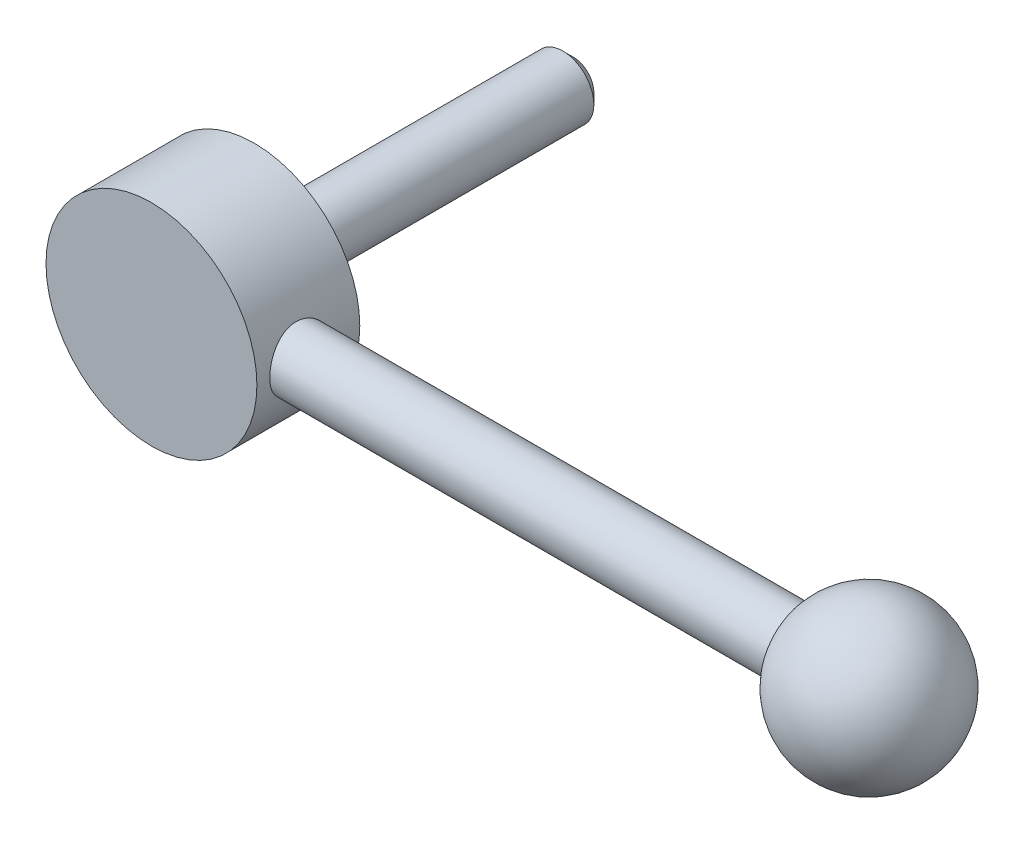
ISO-10303-21;
HEADER;
FILE_DESCRIPTION(('STEP AP214'),'2;1');
FILE_NAME('part.step','',(''),(''),'','','');
FILE_SCHEMA(('AUTOMOTIVE_DESIGN { 1 0 10303 214 1 1 1 1 }'));
ENDSEC;
DATA;
#1=APPLICATION_CONTEXT('core data for automotive mechanical design processes');
#2=APPLICATION_PROTOCOL_DEFINITION('international standard','automotive_design',2000,#1);
#3=PRODUCT_CONTEXT('',#1,'mechanical');
#4=PRODUCT('Part','Part','',(#3));
#5=PRODUCT_RELATED_PRODUCT_CATEGORY('part','',(#4));
#6=PRODUCT_DEFINITION_FORMATION('','',#4);
#7=PRODUCT_DEFINITION_CONTEXT('part definition',#1,'design');
#8=PRODUCT_DEFINITION('design','',#6,#7);
#9=PRODUCT_DEFINITION_SHAPE('','',#8);
#10=(LENGTH_UNIT() NAMED_UNIT(*) SI_UNIT(.MILLI.,.METRE.));
#11=(NAMED_UNIT(*) PLANE_ANGLE_UNIT() SI_UNIT($,.RADIAN.));
#12=(NAMED_UNIT(*) SI_UNIT($,.STERADIAN.) SOLID_ANGLE_UNIT());
#13=UNCERTAINTY_MEASURE_WITH_UNIT(LENGTH_MEASURE(1.E-05),#10,'distance_accuracy_value','');
#14=(GEOMETRIC_REPRESENTATION_CONTEXT(3) GLOBAL_UNCERTAINTY_ASSIGNED_CONTEXT((#13)) GLOBAL_UNIT_ASSIGNED_CONTEXT((#10,
#11,#12)) REPRESENTATION_CONTEXT('',''));
#15=CARTESIAN_POINT('',(0.,0.,0.));
#16=DIRECTION('',(0.,0.,1.));
#17=DIRECTION('',(1.,0.,0.));
#18=AXIS2_PLACEMENT_3D('',#15,#16,#17);
#19=CARTESIAN_POINT('',(0.,0.,40.));
#20=DIRECTION('',(0.,0.,1.));
#21=DIRECTION('',(1.,0.,0.));
#22=AXIS2_PLACEMENT_3D('',#19,#20,#21);
#23=CYLINDRICAL_SURFACE('',#22,9.5);
#24=CARTESIAN_POINT('',(0.,0.,2.));
#25=DIRECTION('',(0.,0.,1.));
#26=DIRECTION('',(1.,0.,0.));
#27=AXIS2_PLACEMENT_3D('',#24,#25,#26);
#28=CIRCLE('',#27,9.5);
#29=CARTESIAN_POINT('',(9.5,0.,2.));
#30=VERTEX_POINT('',#29);
#31=EDGE_CURVE('E37',#30,#30,#28,.T.);
#32=ORIENTED_EDGE('',*,*,#31,.F.);
#33=EDGE_LOOP('',(#32));
#34=FACE_BOUND('',#33,.T.);
#35=CARTESIAN_POINT('',(0.,0.,0.));
#36=DIRECTION('',(0.,0.,1.));
#37=DIRECTION('',(1.,0.,0.));
#38=AXIS2_PLACEMENT_3D('',#35,#36,#37);
#39=CIRCLE('',#38,9.5);
#40=CARTESIAN_POINT('',(9.5,0.,0.));
#41=VERTEX_POINT('',#40);
#42=EDGE_CURVE('E23',#41,#41,#39,.T.);
#43=ORIENTED_EDGE('',*,*,#42,.T.);
#44=EDGE_LOOP('',(#43));
#45=FACE_BOUND('',#44,.T.);
#46=ADVANCED_FACE('F12',(#34,#45),#23,.T.);
#47=CARTESIAN_POINT('',(6.,0.,0.));
#48=DIRECTION('',(0.,0.,1.));
#49=DIRECTION('',(1.,0.,0.));
#50=AXIS2_PLACEMENT_3D('',#47,#48,#49);
#51=PLANE('',#50);
#52=ORIENTED_EDGE('',*,*,#42,.F.);
#53=EDGE_LOOP('',(#52));
#54=FACE_BOUND('',#53,.T.);
#55=CARTESIAN_POINT('',(0.,0.,0.));
#56=DIRECTION('',(0.,0.,1.));
#57=DIRECTION('',(1.,0.,0.));
#58=AXIS2_PLACEMENT_3D('',#55,#56,#57);
#59=CIRCLE('',#58,6.);
#60=CARTESIAN_POINT('',(6.,0.,0.));
#61=VERTEX_POINT('',#60);
#62=EDGE_CURVE('E27',#61,#61,#59,.T.);
#63=ORIENTED_EDGE('',*,*,#62,.T.);
#64=EDGE_LOOP('',(#63));
#65=FACE_BOUND('',#64,.T.);
#66=ADVANCED_FACE('F63',(#54,#65),#51,.F.);
#67=CARTESIAN_POINT('',(0.,0.,40.));
#68=DIRECTION('',(0.,0.,1.));
#69=DIRECTION('',(1.,0.,0.));
#70=AXIS2_PLACEMENT_3D('',#67,#68,#69);
#71=CYLINDRICAL_SURFACE('',#70,6.);
#72=CARTESIAN_POINT('',(0.,0.,-58.));
#73=DIRECTION('',(0.,0.,-1.));
#74=DIRECTION('',(-1.,0.,0.));
#75=AXIS2_PLACEMENT_3D('',#72,#73,#74);
#76=CIRCLE('',#75,6.);
#77=CARTESIAN_POINT('',(-6.,0.,-58.));
#78=VERTEX_POINT('',#77);
#79=EDGE_CURVE('E19',#78,#78,#76,.F.);
#80=ORIENTED_EDGE('',*,*,#79,.T.);
#81=EDGE_LOOP('',(#80));
#82=FACE_BOUND('',#81,.T.);
#83=ORIENTED_EDGE('',*,*,#62,.F.);
#84=EDGE_LOOP('',(#83));
#85=FACE_BOUND('',#84,.T.);
#86=ADVANCED_FACE('F69',(#82,#85),#71,.T.);
#87=CARTESIAN_POINT('',(6.,0.,-60.));
#88=DIRECTION('',(0.,0.,-1.));
#89=DIRECTION('',(-1.,0.,0.));
#90=AXIS2_PLACEMENT_3D('',#87,#88,#89);
#91=PLANE('',#90);
#92=CARTESIAN_POINT('',(0.,0.,-60.));
#93=DIRECTION('',(0.,0.,-1.));
#94=DIRECTION('',(-1.,0.,0.));
#95=AXIS2_PLACEMENT_3D('',#92,#93,#94);
#96=CIRCLE('',#95,4.);
#97=CARTESIAN_POINT('',(-4.,0.,-60.));
#98=VERTEX_POINT('',#97);
#99=EDGE_CURVE('E8',#98,#98,#96,.T.);
#100=ORIENTED_EDGE('',*,*,#99,.T.);
#101=EDGE_LOOP('',(#100));
#102=FACE_BOUND('',#101,.T.);
#103=ADVANCED_FACE('F77',(#102),#91,.T.);
#104=CARTESIAN_POINT('',(20.5,0.,22.));
#105=DIRECTION('',(0.,0.,-1.));
#106=DIRECTION('',(-1.,0.,0.));
#107=AXIS2_PLACEMENT_3D('',#104,#105,#106);
#108=PLANE('',#107);
#109=CARTESIAN_POINT('',(0.,0.,22.));
#110=DIRECTION('',(0.,0.,1.));
#111=DIRECTION('',(1.,0.,0.));
#112=AXIS2_PLACEMENT_3D('',#109,#110,#111);
#113=CIRCLE('',#112,20.5);
#114=CARTESIAN_POINT('',(20.5,0.,22.));
#115=VERTEX_POINT('',#114);
#116=EDGE_CURVE('E86',#115,#115,#113,.T.);
#117=ORIENTED_EDGE('',*,*,#116,.T.);
#118=EDGE_LOOP('',(#117));
#119=FACE_BOUND('',#118,.T.);
#120=ADVANCED_FACE('F58',(#119),#108,.F.);
#121=CARTESIAN_POINT('',(0.,0.,40.));
#122=DIRECTION('',(0.,0.,1.));
#123=DIRECTION('',(1.,0.,0.));
#124=AXIS2_PLACEMENT_3D('',#121,#122,#123);
#125=CYLINDRICAL_SURFACE('',#124,20.5);
#126=CARTESIAN_POINT('',(20.5,0.,7.5));
#127=CARTESIAN_POINT('',(20.4999997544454,-0.164768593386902,7.50000038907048));
#128=CARTESIAN_POINT('',(20.4980087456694,-0.329544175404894,7.50679278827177));
#129=CARTESIAN_POINT('',(20.4900990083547,-0.65788822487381,7.5339021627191));
#130=CARTESIAN_POINT('',(20.4841800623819,-0.821456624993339,7.55421988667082));
#131=CARTESIAN_POINT('',(20.4685766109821,-1.1462122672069,7.60820100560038));
#132=CARTESIAN_POINT('',(20.4588916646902,-1.30739922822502,7.64186596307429));
#133=CARTESIAN_POINT('',(20.4360164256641,-1.62628314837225,7.72226244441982));
#134=CARTESIAN_POINT('',(20.4228249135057,-1.7839788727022,7.76899851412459));
#135=CARTESIAN_POINT('',(20.3933182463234,-2.09448185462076,7.87505403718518));
#136=CARTESIAN_POINT('',(20.3770082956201,-2.24729676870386,7.93435254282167));
#137=CARTESIAN_POINT('',(20.3416823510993,-2.54730770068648,8.06511256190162));
#138=CARTESIAN_POINT('',(20.3226662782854,-2.69450355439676,8.13657443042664));
#139=CARTESIAN_POINT('',(20.2824208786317,-2.98237032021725,8.2911456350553));
#140=CARTESIAN_POINT('',(20.2611910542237,-3.123039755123,8.37425759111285));
#141=CARTESIAN_POINT('',(20.2170775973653,-3.39691169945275,8.55150630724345));
#142=CARTESIAN_POINT('',(20.1941944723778,-3.53011647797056,8.6456396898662));
#143=CARTESIAN_POINT('',(20.146767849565,-3.79154794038,8.84682399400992));
#144=CARTESIAN_POINT('',(20.1221971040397,-3.91956600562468,8.95413966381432));
#145=CARTESIAN_POINT('',(20.0725990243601,-4.1661228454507,9.17897611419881));
#146=CARTESIAN_POINT('',(20.0475718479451,-4.2846648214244,9.29649342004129));
#147=CARTESIAN_POINT('',(19.9977175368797,-4.5116297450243,9.54108035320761));
#148=CARTESIAN_POINT('',(19.9728905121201,-4.62004743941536,9.66815487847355));
#149=CARTESIAN_POINT('',(19.9241410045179,-4.82595045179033,9.93095842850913));
#150=CARTESIAN_POINT('',(19.9002181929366,-4.92343976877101,10.0666842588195));
#151=CARTESIAN_POINT('',(19.8534354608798,-5.10885934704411,10.3490171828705));
#152=CARTESIAN_POINT('',(19.8306098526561,-5.19653638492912,10.4957964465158));
#153=CARTESIAN_POINT('',(19.7872868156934,-5.35913808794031,10.7965125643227));
#154=CARTESIAN_POINT('',(19.766788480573,-5.43406772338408,10.9504465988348));
#155=CARTESIAN_POINT('',(19.7287391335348,-5.57062666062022,11.2645036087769));
#156=CARTESIAN_POINT('',(19.7111887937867,-5.63225293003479,11.4246279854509));
#157=CARTESIAN_POINT('',(19.6796082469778,-5.74162541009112,11.7498143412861));
#158=CARTESIAN_POINT('',(19.6655765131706,-5.78937764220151,11.9148741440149));
#159=CARTESIAN_POINT('',(19.6418018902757,-5.86952471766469,12.2443484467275));
#160=CARTESIAN_POINT('',(19.6319555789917,-5.90229162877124,12.4086649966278));
#161=CARTESIAN_POINT('',(19.6163432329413,-5.95397424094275,12.7395899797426));
#162=CARTESIAN_POINT('',(19.6105755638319,-5.97289549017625,12.9061974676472));
#163=CARTESIAN_POINT('',(19.603301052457,-5.99672775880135,13.2405034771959));
#164=CARTESIAN_POINT('',(19.6017941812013,-6.00163887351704,13.4082019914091));
#165=CARTESIAN_POINT('',(19.6030905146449,-5.99740342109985,13.7434027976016));
#166=CARTESIAN_POINT('',(19.6058936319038,-5.98825713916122,13.9109050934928));
#167=CARTESIAN_POINT('',(19.6155486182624,-5.95655212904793,14.238688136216));
#168=CARTESIAN_POINT('',(19.6222578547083,-5.9344657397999,14.3990190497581));
#169=CARTESIAN_POINT('',(19.6394095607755,-5.87745500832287,14.7172343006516));
#170=CARTESIAN_POINT('',(19.649853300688,-5.84252629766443,14.8751177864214));
#171=CARTESIAN_POINT('',(19.6741615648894,-5.7601395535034,15.187257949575));
#172=CARTESIAN_POINT('',(19.688025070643,-5.71268525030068,15.3415156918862));
#173=CARTESIAN_POINT('',(19.7187796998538,-5.60560692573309,15.6454959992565));
#174=CARTESIAN_POINT('',(19.7356719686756,-5.5459782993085,15.7952168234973));
#175=CARTESIAN_POINT('',(19.7722410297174,-5.41416819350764,16.0910079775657));
#176=CARTESIAN_POINT('',(19.7919506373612,-5.34183608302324,16.2370072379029));
#177=CARTESIAN_POINT('',(19.8334359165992,-5.18568691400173,16.5224423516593));
#178=CARTESIAN_POINT('',(19.8552123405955,-5.10186566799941,16.6618757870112));
#179=CARTESIAN_POINT('',(19.9227548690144,-4.8340177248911,17.0689782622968));
#180=CARTESIAN_POINT('',(19.9707648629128,-4.63350124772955,17.3256854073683));
#181=CARTESIAN_POINT('',(20.0696162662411,-4.18511260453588,17.8126329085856));
#182=CARTESIAN_POINT('',(20.1204944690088,-3.93567819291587,18.0414205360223));
#183=CARTESIAN_POINT('',(20.2176813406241,-3.40132203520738,18.4542852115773));
#184=CARTESIAN_POINT('',(20.2639897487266,-3.11639826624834,18.63835970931));
#185=CARTESIAN_POINT('',(20.3472018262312,-2.51664006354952,18.9573414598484));
#186=CARTESIAN_POINT('',(20.3840462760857,-2.2016334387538,19.0919412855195));
#187=CARTESIAN_POINT('',(20.4437541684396,-1.55212614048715,19.3058343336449));
#188=CARTESIAN_POINT('',(20.4666213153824,-1.21763065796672,19.3851422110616));
#189=CARTESIAN_POINT('',(20.4952175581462,-0.550953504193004,19.4838192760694));
#190=CARTESIAN_POINT('',(20.5015074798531,-0.219085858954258,19.5051506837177));
#191=CARTESIAN_POINT('',(20.4978783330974,0.44350281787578,19.4927506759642));
#192=CARTESIAN_POINT('',(20.4879613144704,0.774223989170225,19.4590262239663));
#193=CARTESIAN_POINT('',(20.4533992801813,1.41781519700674,19.3390673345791));
#194=CARTESIAN_POINT('',(20.4290727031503,1.73091547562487,19.253967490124));
#195=CARTESIAN_POINT('',(20.3684901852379,2.33834273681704,19.0350155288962));
#196=CARTESIAN_POINT('',(20.3322328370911,2.63266749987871,18.901157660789));
#197=CARTESIAN_POINT('',(20.2505580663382,3.201467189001,18.585163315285));
#198=CARTESIAN_POINT('',(20.2049537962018,3.47535043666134,18.4020133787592));
#199=CARTESIAN_POINT('',(20.1098009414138,3.98926947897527,17.9937010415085));
#200=CARTESIAN_POINT('',(20.0602514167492,4.22929716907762,17.7685286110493));
#201=CARTESIAN_POINT('',(19.9860369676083,4.56311282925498,17.3996018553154));
#202=CARTESIAN_POINT('',(19.9608943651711,4.67160496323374,17.2689475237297));
#203=CARTESIAN_POINT('',(19.9116554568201,4.87720494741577,16.9988051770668));
#204=CARTESIAN_POINT('',(19.8875587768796,4.97431688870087,16.8593203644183));
#205=CARTESIAN_POINT('',(19.8411019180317,5.15650338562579,16.5723575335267));
#206=CARTESIAN_POINT('',(19.8187424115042,5.24157329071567,16.4248764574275));
#207=CARTESIAN_POINT('',(19.7764458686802,5.39896546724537,16.1230001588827));
#208=CARTESIAN_POINT('',(19.7565078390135,5.47129297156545,15.9686078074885));
#209=CARTESIAN_POINT('',(19.7197444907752,5.60234699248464,15.6546484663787));
#210=CARTESIAN_POINT('',(19.7029051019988,5.6611353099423,15.49510893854));
#211=CARTESIAN_POINT('',(19.6727610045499,5.76501533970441,15.1713718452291));
#212=CARTESIAN_POINT('',(19.6594548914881,5.81011249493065,15.0071761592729));
#213=CARTESIAN_POINT('',(19.6367999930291,5.88622676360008,14.675294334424));
#214=CARTESIAN_POINT('',(19.6274509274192,5.91724487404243,14.5076084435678));
#215=CARTESIAN_POINT('',(19.6130187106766,5.96490739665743,14.1700260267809));
#216=CARTESIAN_POINT('',(19.6079354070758,5.98155232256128,14.0001295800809));
#217=CARTESIAN_POINT('',(19.6023186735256,5.9999323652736,13.6662567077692));
#218=CARTESIAN_POINT('',(19.6016119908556,6.00223524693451,13.5023141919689));
#219=CARTESIAN_POINT('',(19.6043094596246,5.99341910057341,13.1747666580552));
#220=CARTESIAN_POINT('',(19.6077150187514,5.98229547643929,13.0111617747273));
#221=CARTESIAN_POINT('',(19.6185313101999,5.94672790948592,12.6856110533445));
#222=CARTESIAN_POINT('',(19.6259403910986,5.92228945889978,12.5236645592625));
#223=CARTESIAN_POINT('',(19.6445384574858,5.86030325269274,12.2024601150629));
#224=CARTESIAN_POINT('',(19.6557288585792,5.82275058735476,12.0432031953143));
#225=CARTESIAN_POINT('',(19.6814005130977,5.73537439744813,11.7303823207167));
#226=CARTESIAN_POINT('',(19.6958418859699,5.68569901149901,11.5767736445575));
#227=CARTESIAN_POINT('',(19.7276768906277,5.57423736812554,11.2742707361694));
#228=CARTESIAN_POINT('',(19.7450715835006,5.51244675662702,11.125378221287));
#229=CARTESIAN_POINT('',(19.782319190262,5.37724463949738,10.8333301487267));
#230=CARTESIAN_POINT('',(19.802171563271,5.30383568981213,10.6901733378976));
#231=CARTESIAN_POINT('',(19.8438063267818,5.14587421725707,10.4103722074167));
#232=CARTESIAN_POINT('',(19.8655894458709,5.061317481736,10.2737303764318));
#233=CARTESIAN_POINT('',(19.9112797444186,4.87853600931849,10.0032239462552));
#234=CARTESIAN_POINT('',(19.9352342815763,4.77994030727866,9.86961789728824));
#235=CARTESIAN_POINT('',(19.9839347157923,4.57206196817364,9.61107007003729));
#236=CARTESIAN_POINT('',(20.0086809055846,4.46277534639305,9.48613155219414));
#237=CARTESIAN_POINT('',(20.0582834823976,4.23425660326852,9.24575891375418));
#238=CARTESIAN_POINT('',(20.0831398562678,4.11502564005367,9.13032368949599));
#239=CARTESIAN_POINT('',(20.1323098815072,3.86730499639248,8.90963180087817));
#240=CARTESIAN_POINT('',(20.1566233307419,3.7388119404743,8.80437888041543));
#241=CARTESIAN_POINT('',(20.2046974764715,3.46977987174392,8.6020699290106));
#242=CARTESIAN_POINT('',(20.2284250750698,3.32900807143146,8.50531528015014));
#243=CARTESIAN_POINT('',(20.2739466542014,3.03949915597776,8.32403500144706));
#244=CARTESIAN_POINT('',(20.2957406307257,2.8907620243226,8.23950939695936));
#245=CARTESIAN_POINT('',(20.3367679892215,2.58639447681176,8.0833769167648));
#246=CARTESIAN_POINT('',(20.356002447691,2.43076699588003,8.01176460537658));
#247=CARTESIAN_POINT('',(20.3913677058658,2.11366097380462,7.88201306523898));
#248=CARTESIAN_POINT('',(20.4074988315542,1.95218304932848,7.82387242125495));
#249=CARTESIAN_POINT('',(20.4344672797,1.64423058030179,7.72771145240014));
#250=CARTESIAN_POINT('',(20.4457076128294,1.49828162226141,7.68811373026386));
#251=CARTESIAN_POINT('',(20.4651675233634,1.2036242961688,7.62002138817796));
#252=CARTESIAN_POINT('',(20.4733873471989,1.0549161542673,7.59152586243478));
#253=CARTESIAN_POINT('',(20.4866168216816,0.755624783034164,7.54584620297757));
#254=CARTESIAN_POINT('',(20.491626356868,0.605041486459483,7.52866247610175));
#255=CARTESIAN_POINT('',(20.49831762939,0.302973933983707,7.50574067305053));
#256=CARTESIAN_POINT('',(20.5000002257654,0.151489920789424,7.49999964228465));
#257=CARTESIAN_POINT('',(20.5,0.,7.5));
#258=B_SPLINE_CURVE_WITH_KNOTS('',3,(#126,#127,#128,#129,#130,#131,#132,#133,#134,#135,#136,
#137,#138,#139,#140,#141,#142,#143,#144,#145,#146,#147,#148,#149,#150,#151,#152,#153,#154,#155,
#156,#157,#158,#159,#160,#161,#162,#163,#164,#165,#166,#167,#168,#169,#170,#171,#172,#173,#174,
#175,#176,#177,#178,#179,#180,#181,#182,#183,#184,#185,#186,#187,#188,#189,#190,#191,#192,#193,
#194,#195,#196,#197,#198,#199,#200,#201,#202,#203,#204,#205,#206,#207,#208,#209,#210,#211,#212,
#213,#214,#215,#216,#217,#218,#219,#220,#221,#222,#223,#224,#225,#226,#227,#228,#229,#230,#231,
#232,#233,#234,#235,#236,#237,#238,#239,#240,#241,#242,#243,#244,#245,#246,#247,#248,#249,#250,
#251,#252,#253,#254,#255,#256,#257),.UNSPECIFIED.,.T.,.F.,(4,2,2,2,2,2,2,2,2,2,2,2,2,2,2,2,2,2,
2,2,2,2,2,2,2,2,2,2,2,2,2,2,2,2,2,2,2,2,2,2,2,2,2,2,2,2,2,2,2,2,2,2,2,2,2,2,2,2,2,2,2,2,2,2,2,
4),(0.,0.494166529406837,0.988360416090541,1.48261217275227,1.97703603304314,2.47064184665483,
2.96426207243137,3.45799348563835,3.95157399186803,4.45753270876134,4.96331976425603,
5.46936781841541,5.97523008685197,6.49206535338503,7.00869863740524,7.52544955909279,
8.04197586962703,8.54486934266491,9.04756118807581,9.55024961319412,10.0529278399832,
10.5383093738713,11.0238561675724,11.5092585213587,11.9948448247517,12.4866344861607,
12.9786038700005,13.9617709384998,14.9839152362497,16.006117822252,17.0345689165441,
18.062747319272,19.0556662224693,20.0484595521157,21.0200911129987,21.9918373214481,
22.9853318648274,23.97906383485,24.4935931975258,25.0079370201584,25.5224789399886,
26.0368090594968,26.5487427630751,27.0604726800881,27.5721663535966,28.0838417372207,
28.5751252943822,29.066577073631,29.5578262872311,30.0492596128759,30.5349645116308,
31.0208442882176,31.5066173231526,31.9925744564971,32.4953010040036,32.9982156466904,
33.5010718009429,34.0041121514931,34.5208552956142,35.0375995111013,35.5541256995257,
36.0705976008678,36.525077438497,36.9795201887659,37.4339792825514,37.8883210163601),.UNSPECIFIED.);
#259=CARTESIAN_POINT('',(20.5,0.,7.5));
#260=VERTEX_POINT('',#259);
#261=EDGE_CURVE('E30',#260,#260,#258,.T.);
#262=ORIENTED_EDGE('',*,*,#261,.T.);
#263=EDGE_LOOP('',(#262));
#264=FACE_BOUND('',#263,.T.);
#265=ORIENTED_EDGE('',*,*,#116,.F.);
#266=EDGE_LOOP('',(#265));
#267=FACE_BOUND('',#266,.T.);
#268=CARTESIAN_POINT('',(0.,0.,2.));
#269=DIRECTION('',(0.,0.,1.));
#270=DIRECTION('',(1.,0.,0.));
#271=AXIS2_PLACEMENT_3D('',#268,#269,#270);
#272=CIRCLE('',#271,20.5);
#273=CARTESIAN_POINT('',(20.5,0.,2.));
#274=VERTEX_POINT('',#273);
#275=EDGE_CURVE('E88',#274,#274,#272,.T.);
#276=ORIENTED_EDGE('',*,*,#275,.T.);
#277=EDGE_LOOP('',(#276));
#278=FACE_BOUND('',#277,.T.);
#279=ADVANCED_FACE('F40',(#264,#267,#278),#125,.T.);
#280=CARTESIAN_POINT('',(9.5,0.,2.));
#281=DIRECTION('',(0.,0.,1.));
#282=DIRECTION('',(1.,0.,0.));
#283=AXIS2_PLACEMENT_3D('',#280,#281,#282);
#284=PLANE('',#283);
#285=ORIENTED_EDGE('',*,*,#275,.F.);
#286=EDGE_LOOP('',(#285));
#287=FACE_BOUND('',#286,.T.);
#288=ORIENTED_EDGE('',*,*,#31,.T.);
#289=EDGE_LOOP('',(#288));
#290=FACE_BOUND('',#289,.T.);
#291=ADVANCED_FACE('F49',(#287,#290),#284,.F.);
#292=CARTESIAN_POINT('',(-30.,0.,13.5));
#293=DIRECTION('',(-1.,0.,0.));
#294=DIRECTION('',(0.,0.,1.));
#295=AXIS2_PLACEMENT_3D('',#292,#293,#294);
#296=CYLINDRICAL_SURFACE('',#295,6.);
#297=CARTESIAN_POINT('',(117.252272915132,0.,13.5));
#298=DIRECTION('',(-1.,0.,0.));
#299=DIRECTION('',(0.,0.,1.));
#300=AXIS2_PLACEMENT_3D('',#297,#298,#299);
#301=CIRCLE('',#300,6.);
#302=CARTESIAN_POINT('',(117.252272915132,0.,19.5));
#303=VERTEX_POINT('',#302);
#304=EDGE_CURVE('E38',#303,#303,#301,.T.);
#305=ORIENTED_EDGE('',*,*,#304,.T.);
#306=EDGE_LOOP('',(#305));
#307=FACE_BOUND('',#306,.T.);
#308=ORIENTED_EDGE('',*,*,#261,.F.);
#309=EDGE_LOOP('',(#308));
#310=FACE_BOUND('',#309,.T.);
#311=ADVANCED_FACE('F44',(#307,#310),#296,.T.);
#312=CARTESIAN_POINT('',(131.,0.,13.5));
#313=DIRECTION('',(0.,0.,1.));
#314=DIRECTION('',(1.,0.,0.));
#315=AXIS2_PLACEMENT_3D('',#312,#313,#314);
#316=SPHERICAL_SURFACE('',#315,15.);
#317=CARTESIAN_POINT('',(131.,0.,13.5));
#318=DIRECTION('',(-1.,0.,0.));
#319=DIRECTION('',(0.,0.,1.));
#320=AXIS2_PLACEMENT_3D('',#317,#318,#319);
#321=SPHERICAL_SURFACE('',#320,15.);
#322=ORIENTED_EDGE('',*,*,#304,.F.);
#323=EDGE_LOOP('',(#322));
#324=FACE_BOUND('',#323,.T.);
#325=ADVANCED_FACE('F48',(#324),#321,.T.);
#326=CARTESIAN_POINT('',(0.,0.,-58.));
#327=DIRECTION('',(0.,0.,1.));
#328=DIRECTION('',(1.,0.,0.));
#329=AXIS2_PLACEMENT_3D('',#326,#327,#328);
#330=CONICAL_SURFACE('',#329,6.,0.785398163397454);
#331=ORIENTED_EDGE('',*,*,#99,.F.);
#332=EDGE_LOOP('',(#331));
#333=FACE_BOUND('',#332,.T.);
#334=ORIENTED_EDGE('',*,*,#79,.F.);
#335=EDGE_LOOP('',(#334));
#336=FACE_BOUND('',#335,.T.);
#337=ADVANCED_FACE('F14',(#333,#336),#330,.T.);
#338=CLOSED_SHELL('',(#46,#66,#86,#103,#120,#279,#291,#311,#325,#337));
#339=MANIFOLD_SOLID_BREP('B1',#338);
#340=ADVANCED_BREP_SHAPE_REPRESENTATION('',(#18,#339),#14);
#341=SHAPE_DEFINITION_REPRESENTATION(#9,#340);
ENDSEC;
END-ISO-10303-21;
